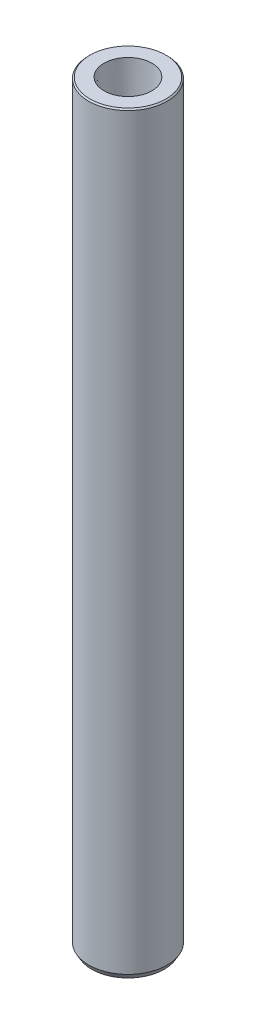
ISO-10303-21;
HEADER;
FILE_DESCRIPTION(('STEP AP214'),'2;1');
FILE_NAME('part.step','',(''),(''),'','','');
FILE_SCHEMA(('AUTOMOTIVE_DESIGN { 1 0 10303 214 1 1 1 1 }'));
ENDSEC;
DATA;
#1=APPLICATION_CONTEXT('core data for automotive mechanical design processes');
#2=APPLICATION_PROTOCOL_DEFINITION('international standard','automotive_design',2000,#1);
#3=PRODUCT_CONTEXT('',#1,'mechanical');
#4=PRODUCT('Part','Part','',(#3));
#5=PRODUCT_RELATED_PRODUCT_CATEGORY('part','',(#4));
#6=PRODUCT_DEFINITION_FORMATION('','',#4);
#7=PRODUCT_DEFINITION_CONTEXT('part definition',#1,'design');
#8=PRODUCT_DEFINITION('design','',#6,#7);
#9=PRODUCT_DEFINITION_SHAPE('','',#8);
#10=(LENGTH_UNIT() NAMED_UNIT(*) SI_UNIT(.MILLI.,.METRE.));
#11=(NAMED_UNIT(*) PLANE_ANGLE_UNIT() SI_UNIT($,.RADIAN.));
#12=(NAMED_UNIT(*) SI_UNIT($,.STERADIAN.) SOLID_ANGLE_UNIT());
#13=UNCERTAINTY_MEASURE_WITH_UNIT(LENGTH_MEASURE(1.E-05),#10,'distance_accuracy_value','');
#14=(GEOMETRIC_REPRESENTATION_CONTEXT(3) GLOBAL_UNCERTAINTY_ASSIGNED_CONTEXT((#13)) GLOBAL_UNIT_ASSIGNED_CONTEXT((#10,
#11,#12)) REPRESENTATION_CONTEXT('',''));
#15=CARTESIAN_POINT('',(0.,0.,0.));
#16=DIRECTION('',(0.,0.,1.));
#17=DIRECTION('',(1.,0.,0.));
#18=AXIS2_PLACEMENT_3D('',#15,#16,#17);
#19=CARTESIAN_POINT('',(0.,144.,0.));
#20=DIRECTION('',(0.,-1.,0.));
#21=DIRECTION('',(0.,0.,-1.));
#22=AXIS2_PLACEMENT_3D('',#19,#20,#21);
#23=CYLINDRICAL_SURFACE('',#22,7.5);
#24=CARTESIAN_POINT('',(0.,143.75,0.));
#25=DIRECTION('',(0.,1.,0.));
#26=DIRECTION('',(0.,0.,1.));
#27=AXIS2_PLACEMENT_3D('',#24,#25,#26);
#28=CIRCLE('',#27,7.5);
#29=CARTESIAN_POINT('',(0.,143.75,7.5));
#30=VERTEX_POINT('',#29);
#31=EDGE_CURVE('E9184',#30,#30,#28,.F.);
#32=ORIENTED_EDGE('',*,*,#31,.T.);
#33=EDGE_LOOP('',(#32));
#34=FACE_BOUND('',#33,.T.);
#35=CARTESIAN_POINT('',(0.,0.999999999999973,0.));
#36=DIRECTION('',(0.,1.,0.));
#37=DIRECTION('',(0.,0.,1.));
#38=AXIS2_PLACEMENT_3D('',#35,#36,#37);
#39=CIRCLE('',#38,7.5);
#40=CARTESIAN_POINT('',(0.,0.999999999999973,7.5));
#41=VERTEX_POINT('',#40);
#42=EDGE_CURVE('E9199',#41,#41,#39,.T.);
#43=ORIENTED_EDGE('',*,*,#42,.T.);
#44=EDGE_LOOP('',(#43));
#45=FACE_BOUND('',#44,.T.);
#46=ADVANCED_FACE('F9173',(#34,#45),#23,.T.);
#47=CARTESIAN_POINT('',(0.,144.,0.));
#48=DIRECTION('',(0.,1.,0.));
#49=DIRECTION('',(0.,0.,1.));
#50=AXIS2_PLACEMENT_3D('',#47,#48,#49);
#51=PLANE('',#50);
#52=CARTESIAN_POINT('',(0.,144.,0.));
#53=DIRECTION('',(0.,1.,0.));
#54=DIRECTION('',(0.,0.,1.));
#55=AXIS2_PLACEMENT_3D('',#52,#53,#54);
#56=CIRCLE('',#55,4.5735);
#57=CARTESIAN_POINT('',(0.,144.,4.5735));
#58=VERTEX_POINT('',#57);
#59=EDGE_CURVE('E9207',#58,#58,#56,.T.);
#60=ORIENTED_EDGE('',*,*,#59,.F.);
#61=EDGE_LOOP('',(#60));
#62=FACE_BOUND('',#61,.T.);
#63=CARTESIAN_POINT('',(0.,144.,0.));
#64=DIRECTION('',(0.,1.,0.));
#65=DIRECTION('',(0.,0.,1.));
#66=AXIS2_PLACEMENT_3D('',#63,#64,#65);
#67=CIRCLE('',#66,7.25);
#68=CARTESIAN_POINT('',(0.,144.,7.25));
#69=VERTEX_POINT('',#68);
#70=EDGE_CURVE('E9193',#69,#69,#67,.T.);
#71=ORIENTED_EDGE('',*,*,#70,.T.);
#72=EDGE_LOOP('',(#71));
#73=FACE_BOUND('',#72,.T.);
#74=ADVANCED_FACE('F9213',(#62,#73),#51,.T.);
#75=CARTESIAN_POINT('',(0.,0.,0.));
#76=DIRECTION('',(0.,1.,0.));
#77=DIRECTION('',(0.,0.,1.));
#78=AXIS2_PLACEMENT_3D('',#75,#76,#77);
#79=PLANE('',#78);
#80=CARTESIAN_POINT('',(0.,0.,0.));
#81=DIRECTION('',(0.,1.,0.));
#82=DIRECTION('',(0.,0.,1.));
#83=AXIS2_PLACEMENT_3D('',#80,#81,#82);
#84=CIRCLE('',#83,4.75);
#85=CARTESIAN_POINT('',(0.,0.,4.75));
#86=VERTEX_POINT('',#85);
#87=EDGE_CURVE('E10',#86,#86,#84,.T.);
#88=ORIENTED_EDGE('',*,*,#87,.T.);
#89=EDGE_LOOP('',(#88));
#90=FACE_BOUND('',#89,.T.);
#91=CARTESIAN_POINT('',(0.,0.,0.));
#92=DIRECTION('',(0.,1.,0.));
#93=DIRECTION('',(0.,0.,1.));
#94=AXIS2_PLACEMENT_3D('',#91,#92,#93);
#95=CIRCLE('',#94,6.92264973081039);
#96=CARTESIAN_POINT('',(0.,0.,6.92264973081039));
#97=VERTEX_POINT('',#96);
#98=EDGE_CURVE('E9196',#97,#97,#95,.F.);
#99=ORIENTED_EDGE('',*,*,#98,.T.);
#100=EDGE_LOOP('',(#99));
#101=FACE_BOUND('',#100,.T.);
#102=ADVANCED_FACE('F9216',(#90,#101),#79,.F.);
#103=CARTESIAN_POINT('',(0.,0.999999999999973,0.));
#104=DIRECTION('',(0.,1.,0.));
#105=DIRECTION('',(0.,0.,1.));
#106=AXIS2_PLACEMENT_3D('',#103,#104,#105);
#107=CONICAL_SURFACE('',#106,7.5,0.523598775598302);
#108=ORIENTED_EDGE('',*,*,#98,.F.);
#109=EDGE_LOOP('',(#108));
#110=FACE_BOUND('',#109,.T.);
#111=ORIENTED_EDGE('',*,*,#42,.F.);
#112=EDGE_LOOP('',(#111));
#113=FACE_BOUND('',#112,.T.);
#114=ADVANCED_FACE('F9244',(#110,#113),#107,.T.);
#115=CARTESIAN_POINT('',(0.,17.,0.));
#116=DIRECTION('',(0.,-1.,0.));
#117=DIRECTION('',(0.,0.,-1.));
#118=AXIS2_PLACEMENT_3D('',#115,#116,#117);
#119=CYLINDRICAL_SURFACE('',#118,4.5);
#120=CARTESIAN_POINT('',(0.,0.25,0.));
#121=DIRECTION('',(0.,1.,0.));
#122=DIRECTION('',(0.,0.,1.));
#123=AXIS2_PLACEMENT_3D('',#120,#121,#122);
#124=CIRCLE('',#123,4.5);
#125=CARTESIAN_POINT('',(0.,0.25,4.5));
#126=VERTEX_POINT('',#125);
#127=EDGE_CURVE('E9180',#126,#126,#124,.F.);
#128=ORIENTED_EDGE('',*,*,#127,.T.);
#129=EDGE_LOOP('',(#128));
#130=FACE_BOUND('',#129,.T.);
#131=CARTESIAN_POINT('',(0.,17.,0.));
#132=DIRECTION('',(0.,-1.,0.));
#133=DIRECTION('',(0.,0.,-1.));
#134=AXIS2_PLACEMENT_3D('',#131,#132,#133);
#135=CIRCLE('',#134,4.5);
#136=CARTESIAN_POINT('',(0.,17.,-4.5));
#137=VERTEX_POINT('',#136);
#138=EDGE_CURVE('E9190',#137,#137,#135,.T.);
#139=ORIENTED_EDGE('',*,*,#138,.F.);
#140=EDGE_LOOP('',(#139));
#141=FACE_BOUND('',#140,.T.);
#142=ADVANCED_FACE('F9233',(#130,#141),#119,.F.);
#143=CARTESIAN_POINT('',(0.,17.,0.));
#144=DIRECTION('',(0.,-1.,0.));
#145=DIRECTION('',(0.,0.,-1.));
#146=AXIS2_PLACEMENT_3D('',#143,#144,#145);
#147=PLANE('',#146);
#148=CARTESIAN_POINT('',(0.,17.,0.));
#149=DIRECTION('',(0.,-1.,0.));
#150=DIRECTION('',(0.,0.,-1.));
#151=AXIS2_PLACEMENT_3D('',#148,#149,#150);
#152=CIRCLE('',#151,4.);
#153=CARTESIAN_POINT('',(0.,17.,-4.));
#154=VERTEX_POINT('',#153);
#155=EDGE_CURVE('E9187',#154,#154,#152,.T.);
#156=ORIENTED_EDGE('',*,*,#155,.F.);
#157=EDGE_LOOP('',(#156));
#158=FACE_BOUND('',#157,.T.);
#159=ORIENTED_EDGE('',*,*,#138,.T.);
#160=EDGE_LOOP('',(#159));
#161=FACE_BOUND('',#160,.T.);
#162=ADVANCED_FACE('F9222',(#158,#161),#147,.T.);
#163=CARTESIAN_POINT('',(0.,144.,0.));
#164=DIRECTION('',(0.,-1.,0.));
#165=DIRECTION('',(0.,0.,-1.));
#166=AXIS2_PLACEMENT_3D('',#163,#164,#165);
#167=CONICAL_SURFACE('',#166,7.25,0.78539816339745);
#168=ORIENTED_EDGE('',*,*,#31,.F.);
#169=EDGE_LOOP('',(#168));
#170=FACE_BOUND('',#169,.T.);
#171=ORIENTED_EDGE('',*,*,#70,.F.);
#172=EDGE_LOOP('',(#171));
#173=FACE_BOUND('',#172,.T.);
#174=ADVANCED_FACE('F9219',(#170,#173),#167,.T.);
#175=CARTESIAN_POINT('',(0.,-56.,0.));
#176=DIRECTION('',(0.,1.,0.));
#177=DIRECTION('',(0.,0.,1.));
#178=AXIS2_PLACEMENT_3D('',#175,#176,#177);
#179=CYLINDRICAL_SURFACE('',#178,4.);
#180=CARTESIAN_POINT('',(0.,136.6,0.));
#181=DIRECTION('',(0.,-1.,0.));
#182=DIRECTION('',(0.,0.,-1.));
#183=AXIS2_PLACEMENT_3D('',#180,#181,#182);
#184=CIRCLE('',#183,4.);
#185=CARTESIAN_POINT('',(0.,136.6,-4.));
#186=VERTEX_POINT('',#185);
#187=EDGE_CURVE('E9176',#186,#186,#184,.F.);
#188=ORIENTED_EDGE('',*,*,#187,.T.);
#189=EDGE_LOOP('',(#188));
#190=FACE_BOUND('',#189,.T.);
#191=ORIENTED_EDGE('',*,*,#155,.T.);
#192=EDGE_LOOP('',(#191));
#193=FACE_BOUND('',#192,.T.);
#194=ADVANCED_FACE('F9221',(#190,#193),#179,.F.);
#195=CARTESIAN_POINT('',(0.,0.25,0.));
#196=DIRECTION('',(0.,-1.,0.));
#197=DIRECTION('',(0.,0.,-1.));
#198=AXIS2_PLACEMENT_3D('',#195,#196,#197);
#199=CONICAL_SURFACE('',#198,4.5,0.78539816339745);
#200=ORIENTED_EDGE('',*,*,#87,.F.);
#201=EDGE_LOOP('',(#200));
#202=FACE_BOUND('',#201,.T.);
#203=ORIENTED_EDGE('',*,*,#127,.F.);
#204=EDGE_LOOP('',(#203));
#205=FACE_BOUND('',#204,.T.);
#206=ADVANCED_FACE('F9230',(#202,#205),#199,.F.);
#207=CARTESIAN_POINT('',(3.95,136.6,0.));
#208=DIRECTION('',(0.,-1.,0.));
#209=DIRECTION('',(0.,0.,-1.));
#210=AXIS2_PLACEMENT_3D('',#207,#208,#209);
#211=PLANE('',#210);
#212=CARTESIAN_POINT('',(0.,136.6,0.));
#213=DIRECTION('',(0.,1.,0.));
#214=DIRECTION('',(0.,0.,1.));
#215=AXIS2_PLACEMENT_3D('',#212,#213,#214);
#216=CIRCLE('',#215,4.34249700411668);
#217=CARTESIAN_POINT('',(0.,136.6,4.34249700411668));
#218=VERTEX_POINT('',#217);
#219=EDGE_CURVE('E9204',#218,#218,#216,.T.);
#220=ORIENTED_EDGE('',*,*,#219,.T.);
#221=EDGE_LOOP('',(#220));
#222=FACE_BOUND('',#221,.T.);
#223=ORIENTED_EDGE('',*,*,#187,.F.);
#224=EDGE_LOOP('',(#223));
#225=FACE_BOUND('',#224,.T.);
#226=ADVANCED_FACE('F9270',(#222,#225),#211,.F.);
#227=CARTESIAN_POINT('',(0.,144.,0.));
#228=DIRECTION('',(0.,1.,0.));
#229=DIRECTION('',(0.,0.,1.));
#230=AXIS2_PLACEMENT_3D('',#227,#228,#229);
#231=CONICAL_SURFACE('',#230,4.5735,0.0312064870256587);
#232=ORIENTED_EDGE('',*,*,#219,.F.);
#233=EDGE_LOOP('',(#232));
#234=FACE_BOUND('',#233,.T.);
#235=ORIENTED_EDGE('',*,*,#59,.T.);
#236=EDGE_LOOP('',(#235));
#237=FACE_BOUND('',#236,.T.);
#238=ADVANCED_FACE('F9211',(#234,#237),#231,.F.);
#239=CLOSED_SHELL('',(#46,#74,#102,#114,#142,#162,#174,#194,#206,#226,#238));
#240=MANIFOLD_SOLID_BREP('B2',#239);
#241=ADVANCED_BREP_SHAPE_REPRESENTATION('',(#18,#240),#14);
#242=SHAPE_DEFINITION_REPRESENTATION(#9,#241);
ENDSEC;
END-ISO-10303-21;
